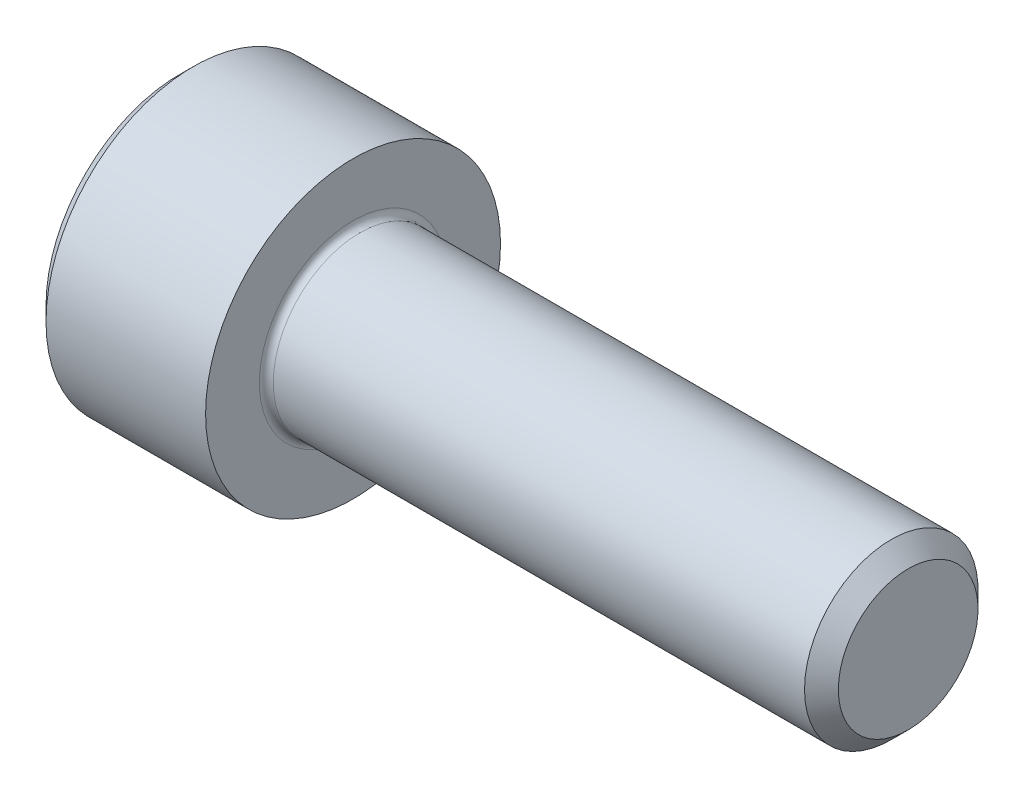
ISO-10303-21;
HEADER;
FILE_DESCRIPTION(('STEP AP214'),'2;1');
FILE_NAME('part.step','',(''),(''),'','','');
FILE_SCHEMA(('AUTOMOTIVE_DESIGN { 1 0 10303 214 1 1 1 1 }'));
ENDSEC;
DATA;
#1=APPLICATION_CONTEXT('core data for automotive mechanical design processes');
#2=APPLICATION_PROTOCOL_DEFINITION('international standard','automotive_design',2000,#1);
#3=PRODUCT_CONTEXT('',#1,'mechanical');
#4=PRODUCT('Part','Part','',(#3));
#5=PRODUCT_RELATED_PRODUCT_CATEGORY('part','',(#4));
#6=PRODUCT_DEFINITION_FORMATION('','',#4);
#7=PRODUCT_DEFINITION_CONTEXT('part definition',#1,'design');
#8=PRODUCT_DEFINITION('design','',#6,#7);
#9=PRODUCT_DEFINITION_SHAPE('','',#8);
#10=(LENGTH_UNIT() NAMED_UNIT(*) SI_UNIT(.MILLI.,.METRE.));
#11=(NAMED_UNIT(*) PLANE_ANGLE_UNIT() SI_UNIT($,.RADIAN.));
#12=(NAMED_UNIT(*) SI_UNIT($,.STERADIAN.) SOLID_ANGLE_UNIT());
#13=UNCERTAINTY_MEASURE_WITH_UNIT(LENGTH_MEASURE(1.E-05),#10,'distance_accuracy_value','');
#14=(GEOMETRIC_REPRESENTATION_CONTEXT(3) GLOBAL_UNCERTAINTY_ASSIGNED_CONTEXT((#13)) GLOBAL_UNIT_ASSIGNED_CONTEXT((#10,
#11,#12)) REPRESENTATION_CONTEXT('',''));
#15=CARTESIAN_POINT('',(0.,0.,0.));
#16=DIRECTION('',(0.,0.,1.));
#17=DIRECTION('',(1.,0.,0.));
#18=AXIS2_PLACEMENT_3D('',#15,#16,#17);
#19=CARTESIAN_POINT('',(0.,0.,0.));
#20=DIRECTION('',(-1.,0.,0.));
#21=DIRECTION('',(0.,0.,1.));
#22=AXIS2_PLACEMENT_3D('',#19,#20,#21);
#23=PLANE('',#22);
#24=DIRECTION('',(0.,-0.499999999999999,0.866025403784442));
#25=VECTOR('',#24,1.);
#26=CARTESIAN_POINT('',(-4.44089209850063E-13,1.77304267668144,-1.38777878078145E-13));
#27=LINE('',#26,#25);
#28=CARTESIAN_POINT('',(-4.44089209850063E-13,1.77304267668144,-1.38777878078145E-13));
#29=VERTEX_POINT('',#28);
#30=CARTESIAN_POINT('',(0.,0.886521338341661,1.53549999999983));
#31=VERTEX_POINT('',#30);
#32=EDGE_CURVE('E268',#29,#31,#27,.T.);
#33=ORIENTED_EDGE('',*,*,#32,.T.);
#34=DIRECTION('',(0.,1.,0.));
#35=VECTOR('',#34,1.);
#36=CARTESIAN_POINT('',(0.,-0.886521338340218,1.53550000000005));
#37=LINE('',#36,#35);
#38=CARTESIAN_POINT('',(0.,-0.886521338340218,1.53550000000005));
#39=VERTEX_POINT('',#38);
#40=EDGE_CURVE('E128',#39,#31,#37,.T.);
#41=ORIENTED_EDGE('',*,*,#40,.F.);
#42=DIRECTION('',(0.,-0.500000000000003,-0.866025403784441));
#43=VECTOR('',#42,1.);
#44=CARTESIAN_POINT('',(0.,-0.886521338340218,1.53550000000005));
#45=LINE('',#44,#43);
#46=CARTESIAN_POINT('',(-4.44089209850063E-13,-1.77304267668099,4.16333634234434E-13));
#47=VERTEX_POINT('',#46);
#48=EDGE_CURVE('E271',#39,#47,#45,.T.);
#49=ORIENTED_EDGE('',*,*,#48,.T.);
#50=DIRECTION('',(0.,0.499999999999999,-0.866025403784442));
#51=VECTOR('',#50,1.);
#52=CARTESIAN_POINT('',(-4.44089209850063E-13,-1.77304267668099,4.16333634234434E-13));
#53=LINE('',#52,#51);
#54=CARTESIAN_POINT('',(-4.44089209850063E-13,-0.886521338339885,-1.53550000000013));
#55=VERTEX_POINT('',#54);
#56=EDGE_CURVE('E274',#47,#55,#53,.T.);
#57=ORIENTED_EDGE('',*,*,#56,.T.);
#58=DIRECTION('',(0.,-1.,0.));
#59=VECTOR('',#58,1.);
#60=CARTESIAN_POINT('',(-4.44089209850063E-13,0.886521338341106,-1.53550000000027));
#61=LINE('',#60,#59);
#62=CARTESIAN_POINT('',(-4.44089209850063E-13,0.886521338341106,-1.53550000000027));
#63=VERTEX_POINT('',#62);
#64=EDGE_CURVE('E277',#63,#55,#61,.T.);
#65=ORIENTED_EDGE('',*,*,#64,.F.);
#66=DIRECTION('',(0.,-0.500000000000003,-0.866025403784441));
#67=VECTOR('',#66,1.);
#68=CARTESIAN_POINT('',(-4.44089209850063E-13,1.77304267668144,-1.38777878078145E-13));
#69=LINE('',#68,#67);
#70=EDGE_CURVE('E123',#29,#63,#69,.T.);
#71=ORIENTED_EDGE('',*,*,#70,.F.);
#72=EDGE_LOOP('',(#33,#41,#49,#57,#65,#71));
#73=FACE_BOUND('',#72,.T.);
#74=CARTESIAN_POINT('',(0.,0.,0.));
#75=DIRECTION('',(-1.,0.,0.));
#76=DIRECTION('',(0.,0.,1.));
#77=AXIS2_PLACEMENT_3D('',#74,#75,#76);
#78=CIRCLE('',#77,3.85);
#79=CARTESIAN_POINT('',(0.,0.,3.85000000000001));
#80=VERTEX_POINT('',#79);
#81=EDGE_CURVE('E152',#80,#80,#78,.T.);
#82=ORIENTED_EDGE('',*,*,#81,.T.);
#83=EDGE_LOOP('',(#82));
#84=FACE_BOUND('',#83,.T.);
#85=ADVANCED_FACE('F36',(#73,#84),#23,.T.);
#86=CARTESIAN_POINT('',(0.,0.,0.));
#87=DIRECTION('',(1.,0.,0.));
#88=DIRECTION('',(0.,0.,-1.));
#89=AXIS2_PLACEMENT_3D('',#86,#87,#88);
#90=CONICAL_SURFACE('',#89,3.85,0.785398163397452);
#91=CARTESIAN_POINT('',(0.400000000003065,1.11022302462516E-13,2.4980018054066E-13));
#92=DIRECTION('',(-1.,0.,0.));
#93=DIRECTION('',(0.,0.,1.));
#94=AXIS2_PLACEMENT_3D('',#91,#92,#93);
#95=CIRCLE('',#94,4.25);
#96=CARTESIAN_POINT('',(0.400000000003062,1.12511562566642E-13,4.25000000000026));
#97=VERTEX_POINT('',#96);
#98=EDGE_CURVE('E149',#97,#97,#95,.T.);
#99=ORIENTED_EDGE('',*,*,#98,.T.);
#100=EDGE_LOOP('',(#99));
#101=FACE_BOUND('',#100,.T.);
#102=ORIENTED_EDGE('',*,*,#81,.F.);
#103=EDGE_LOOP('',(#102));
#104=FACE_BOUND('',#103,.T.);
#105=ADVANCED_FACE('F173',(#101,#104),#90,.T.);
#106=CARTESIAN_POINT('',(-31.7500000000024,5.55111512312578E-13,1.38777878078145E-13));
#107=DIRECTION('',(-1.,0.,0.));
#108=DIRECTION('',(0.,0.,1.));
#109=AXIS2_PLACEMENT_3D('',#106,#107,#108);
#110=CYLINDRICAL_SURFACE('',#109,4.25);
#111=CARTESIAN_POINT('',(4.99999999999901,1.11022302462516E-13,8.88178419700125E-13));
#112=DIRECTION('',(-1.,0.,0.));
#113=DIRECTION('',(0.,0.,1.));
#114=AXIS2_PLACEMENT_3D('',#111,#112,#113);
#115=CIRCLE('',#114,4.25);
#116=CARTESIAN_POINT('',(4.999999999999,1.12511562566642E-13,4.2500000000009));
#117=VERTEX_POINT('',#116);
#118=EDGE_CURVE('E146',#117,#117,#115,.T.);
#119=ORIENTED_EDGE('',*,*,#118,.T.);
#120=EDGE_LOOP('',(#119));
#121=FACE_BOUND('',#120,.T.);
#122=ORIENTED_EDGE('',*,*,#98,.F.);
#123=EDGE_LOOP('',(#122));
#124=FACE_BOUND('',#123,.T.);
#125=ADVANCED_FACE('F178',(#121,#124),#110,.T.);
#126=CARTESIAN_POINT('',(5.00000000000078,4.25000000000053,0.));
#127=DIRECTION('',(1.,0.,0.));
#128=DIRECTION('',(0.,0.,-1.));
#129=AXIS2_PLACEMENT_3D('',#126,#127,#128);
#130=PLANE('',#129);
#131=CARTESIAN_POINT('',(4.99999999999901,1.11022302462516E-13,8.88178419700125E-13));
#132=DIRECTION('',(1.,0.,0.));
#133=DIRECTION('',(0.,0.,-1.));
#134=AXIS2_PLACEMENT_3D('',#131,#132,#133);
#135=CIRCLE('',#134,2.69999999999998);
#136=CARTESIAN_POINT('',(4.99999999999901,1.10076184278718E-13,-2.69999999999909));
#137=VERTEX_POINT('',#136);
#138=EDGE_CURVE('E44',#137,#137,#135,.F.);
#139=ORIENTED_EDGE('',*,*,#138,.T.);
#140=EDGE_LOOP('',(#139));
#141=FACE_BOUND('',#140,.T.);
#142=ORIENTED_EDGE('',*,*,#118,.F.);
#143=EDGE_LOOP('',(#142));
#144=FACE_BOUND('',#143,.T.);
#145=ADVANCED_FACE('F157',(#141,#144),#130,.T.);
#146=CARTESIAN_POINT('',(-31.7500000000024,5.55111512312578E-13,1.38777878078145E-13));
#147=DIRECTION('',(-1.,0.,0.));
#148=DIRECTION('',(0.,0.,1.));
#149=AXIS2_PLACEMENT_3D('',#146,#147,#148);
#150=CYLINDRICAL_SURFACE('',#149,2.49999999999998);
#151=CARTESIAN_POINT('',(5.20000000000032,1.11022302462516E-13,1.13797860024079E-12));
#152=DIRECTION('',(1.,0.,0.));
#153=DIRECTION('',(0.,0.,-1.));
#154=AXIS2_PLACEMENT_3D('',#151,#152,#153);
#155=CIRCLE('',#154,2.49999999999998);
#156=CARTESIAN_POINT('',(5.20000000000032,1.10146267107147E-13,-2.49999999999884));
#157=VERTEX_POINT('',#156);
#158=EDGE_CURVE('E11',#157,#157,#155,.T.);
#159=ORIENTED_EDGE('',*,*,#158,.T.);
#160=EDGE_LOOP('',(#159));
#161=FACE_BOUND('',#160,.T.);
#162=CARTESIAN_POINT('',(20.5124999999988,5.55111512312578E-13,3.60822483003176E-13));
#163=DIRECTION('',(-1.,0.,0.));
#164=DIRECTION('',(0.,0.,1.));
#165=AXIS2_PLACEMENT_3D('',#162,#163,#164);
#166=CIRCLE('',#165,2.49999999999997);
#167=CARTESIAN_POINT('',(20.5124999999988,5.55987547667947E-13,2.50000000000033));
#168=VERTEX_POINT('',#167);
#169=EDGE_CURVE('E143',#168,#168,#166,.T.);
#170=ORIENTED_EDGE('',*,*,#169,.T.);
#171=EDGE_LOOP('',(#170));
#172=FACE_BOUND('',#171,.T.);
#173=ADVANCED_FACE('F188',(#161,#172),#150,.T.);
#174=CARTESIAN_POINT('',(20.9999999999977,3.33066907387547E-13,1.94289029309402E-13));
#175=DIRECTION('',(-1.,0.,0.));
#176=DIRECTION('',(0.,0.,1.));
#177=AXIS2_PLACEMENT_3D('',#174,#175,#176);
#178=CONICAL_SURFACE('',#177,2.0125,0.785398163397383);
#179=ORIENTED_EDGE('',*,*,#169,.F.);
#180=EDGE_LOOP('',(#179));
#181=FACE_BOUND('',#180,.T.);
#182=CARTESIAN_POINT('',(20.9999999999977,3.33066907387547E-13,1.94289029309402E-13));
#183=DIRECTION('',(-1.,0.,0.));
#184=DIRECTION('',(0.,0.,1.));
#185=AXIS2_PLACEMENT_3D('',#182,#183,#184);
#186=CIRCLE('',#185,2.0125);
#187=CARTESIAN_POINT('',(20.9999999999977,3.33772115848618E-13,2.0125000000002));
#188=VERTEX_POINT('',#187);
#189=EDGE_CURVE('E139',#188,#188,#186,.T.);
#190=ORIENTED_EDGE('',*,*,#189,.T.);
#191=EDGE_LOOP('',(#190));
#192=FACE_BOUND('',#191,.T.);
#193=ADVANCED_FACE('F168',(#181,#192),#178,.T.);
#194=CARTESIAN_POINT('',(20.9999999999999,2.01249999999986,3.33066907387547E-13));
#195=DIRECTION('',(1.,0.,0.));
#196=DIRECTION('',(0.,0.,-1.));
#197=AXIS2_PLACEMENT_3D('',#194,#195,#196);
#198=PLANE('',#197);
#199=ORIENTED_EDGE('',*,*,#189,.F.);
#200=EDGE_LOOP('',(#199));
#201=FACE_BOUND('',#200,.T.);
#202=ADVANCED_FACE('F161',(#201),#198,.T.);
#203=CARTESIAN_POINT('',(5.20000000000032,1.11022302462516E-13,1.13797860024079E-12));
#204=DIRECTION('',(1.,0.,0.));
#205=DIRECTION('',(0.,0.,-1.));
#206=AXIS2_PLACEMENT_3D('',#203,#204,#205);
#207=TOROIDAL_SURFACE('',#206,2.69999999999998,0.2);
#208=ORIENTED_EDGE('',*,*,#158,.F.);
#209=EDGE_LOOP('',(#208));
#210=FACE_BOUND('',#209,.T.);
#211=ORIENTED_EDGE('',*,*,#138,.F.);
#212=EDGE_LOOP('',(#211));
#213=FACE_BOUND('',#212,.T.);
#214=ADVANCED_FACE('F38',(#210,#213),#207,.F.);
#215=CARTESIAN_POINT('',(2.00000000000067,1.77304267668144,2.22044604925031E-13));
#216=DIRECTION('',(0.,-0.866025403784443,-0.5));
#217=DIRECTION('',(0.,0.499999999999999,-0.866025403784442));
#218=AXIS2_PLACEMENT_3D('',#215,#216,#217);
#219=PLANE('',#218);
#220=ORIENTED_EDGE('',*,*,#32,.F.);
#221=DIRECTION('',(-1.,0.,0.));
#222=VECTOR('',#221,1.);
#223=CARTESIAN_POINT('',(2.00000000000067,1.77304267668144,2.22044604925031E-13));
#224=LINE('',#223,#222);
#225=CARTESIAN_POINT('',(2.00000000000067,1.77304267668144,2.22044604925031E-13));
#226=VERTEX_POINT('',#225);
#227=EDGE_CURVE('E267',#226,#29,#224,.T.);
#228=ORIENTED_EDGE('',*,*,#227,.F.);
#229=DIRECTION('',(0.,-0.499999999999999,0.866025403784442));
#230=VECTOR('',#229,1.);
#231=CARTESIAN_POINT('',(2.00000000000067,1.77304267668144,2.22044604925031E-13));
#232=LINE('',#231,#230);
#233=CARTESIAN_POINT('',(1.99999999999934,1.32978200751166,0.767749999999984));
#234=VERTEX_POINT('',#233);
#235=EDGE_CURVE('E51',#226,#234,#232,.T.);
#236=ORIENTED_EDGE('',*,*,#235,.T.);
#237=CARTESIAN_POINT('',(1.99999999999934,0.886521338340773,1.53549999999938));
#238=VERTEX_POINT('',#237);
#239=EDGE_CURVE('E109',#234,#238,#232,.T.);
#240=ORIENTED_EDGE('',*,*,#239,.T.);
#241=DIRECTION('',(-1.,0.,0.));
#242=VECTOR('',#241,1.);
#243=CARTESIAN_POINT('',(1.99999999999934,0.886521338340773,1.53549999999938));
#244=LINE('',#243,#242);
#245=EDGE_CURVE('E121',#238,#31,#244,.T.);
#246=ORIENTED_EDGE('',*,*,#245,.T.);
#247=EDGE_LOOP('',(#220,#228,#236,#240,#246));
#248=FACE_BOUND('',#247,.T.);
#249=ADVANCED_FACE('F120',(#248),#219,.T.);
#250=CARTESIAN_POINT('',(1.99999999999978,-0.886521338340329,1.53549999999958));
#251=DIRECTION('',(0.,0.,1.));
#252=DIRECTION('',(0.,-1.,0.));
#253=AXIS2_PLACEMENT_3D('',#250,#251,#252);
#254=PLANE('',#253);
#255=ORIENTED_EDGE('',*,*,#40,.T.);
#256=ORIENTED_EDGE('',*,*,#245,.F.);
#257=DIRECTION('',(0.,1.,0.));
#258=VECTOR('',#257,1.);
#259=CARTESIAN_POINT('',(1.99999999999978,-0.886521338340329,1.53549999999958));
#260=LINE('',#259,#258);
#261=CARTESIAN_POINT('',(1.99999999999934,0.,1.53550000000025));
#262=VERTEX_POINT('',#261);
#263=EDGE_CURVE('E107',#262,#238,#260,.T.);
#264=ORIENTED_EDGE('',*,*,#263,.F.);
#265=CARTESIAN_POINT('',(1.99999999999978,-0.886521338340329,1.53549999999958));
#266=VERTEX_POINT('',#265);
#267=EDGE_CURVE('E117',#266,#262,#260,.T.);
#268=ORIENTED_EDGE('',*,*,#267,.F.);
#269=DIRECTION('',(-1.,0.,0.));
#270=VECTOR('',#269,1.);
#271=CARTESIAN_POINT('',(1.99999999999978,-0.886521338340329,1.53549999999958));
#272=LINE('',#271,#270);
#273=EDGE_CURVE('E130',#266,#39,#272,.T.);
#274=ORIENTED_EDGE('',*,*,#273,.T.);
#275=EDGE_LOOP('',(#255,#256,#264,#268,#274));
#276=FACE_BOUND('',#275,.T.);
#277=ADVANCED_FACE('F125',(#276),#254,.F.);
#278=CARTESIAN_POINT('',(1.99999999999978,-0.886521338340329,1.53549999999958));
#279=DIRECTION('',(0.,0.86602540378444,-0.500000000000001));
#280=DIRECTION('',(0.,0.500000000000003,0.866025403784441));
#281=AXIS2_PLACEMENT_3D('',#278,#279,#280);
#282=PLANE('',#281);
#283=ORIENTED_EDGE('',*,*,#48,.F.);
#284=ORIENTED_EDGE('',*,*,#273,.F.);
#285=DIRECTION('',(0.,-0.500000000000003,-0.866025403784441));
#286=VECTOR('',#285,1.);
#287=CARTESIAN_POINT('',(1.99999999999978,-0.886521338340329,1.53549999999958));
#288=LINE('',#287,#286);
#289=CARTESIAN_POINT('',(1.99999999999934,-1.32978200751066,0.767750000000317));
#290=VERTEX_POINT('',#289);
#291=EDGE_CURVE('E248',#266,#290,#288,.T.);
#292=ORIENTED_EDGE('',*,*,#291,.T.);
#293=CARTESIAN_POINT('',(1.99999999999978,-1.77304267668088,1.94289029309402E-13));
#294=VERTEX_POINT('',#293);
#295=EDGE_CURVE('E250',#290,#294,#288,.T.);
#296=ORIENTED_EDGE('',*,*,#295,.T.);
#297=DIRECTION('',(-1.,0.,0.));
#298=VECTOR('',#297,1.);
#299=CARTESIAN_POINT('',(1.99999999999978,-1.77304267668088,1.94289029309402E-13));
#300=LINE('',#299,#298);
#301=EDGE_CURVE('E135',#294,#47,#300,.T.);
#302=ORIENTED_EDGE('',*,*,#301,.T.);
#303=EDGE_LOOP('',(#283,#284,#292,#296,#302));
#304=FACE_BOUND('',#303,.T.);
#305=ADVANCED_FACE('F200',(#304),#282,.T.);
#306=CARTESIAN_POINT('',(1.99999999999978,-1.77304267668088,1.94289029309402E-13));
#307=DIRECTION('',(0.,0.866025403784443,0.5));
#308=DIRECTION('',(0.,-0.499999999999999,0.866025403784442));
#309=AXIS2_PLACEMENT_3D('',#306,#307,#308);
#310=PLANE('',#309);
#311=ORIENTED_EDGE('',*,*,#56,.F.);
#312=ORIENTED_EDGE('',*,*,#301,.F.);
#313=DIRECTION('',(0.,0.499999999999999,-0.866025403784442));
#314=VECTOR('',#313,1.);
#315=CARTESIAN_POINT('',(1.99999999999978,-1.77304267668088,1.94289029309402E-13));
#316=LINE('',#315,#314);
#317=CARTESIAN_POINT('',(1.99999999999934,-1.32978200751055,-0.767749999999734));
#318=VERTEX_POINT('',#317);
#319=EDGE_CURVE('E253',#294,#318,#316,.T.);
#320=ORIENTED_EDGE('',*,*,#319,.T.);
#321=CARTESIAN_POINT('',(1.99999999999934,-0.886521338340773,-1.53550000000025));
#322=VERTEX_POINT('',#321);
#323=EDGE_CURVE('E257',#318,#322,#316,.T.);
#324=ORIENTED_EDGE('',*,*,#323,.T.);
#325=DIRECTION('',(-1.,0.,0.));
#326=VECTOR('',#325,1.);
#327=CARTESIAN_POINT('',(1.99999999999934,-0.886521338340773,-1.53550000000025));
#328=LINE('',#327,#326);
#329=EDGE_CURVE('E286',#322,#55,#328,.T.);
#330=ORIENTED_EDGE('',*,*,#329,.T.);
#331=EDGE_LOOP('',(#311,#312,#320,#324,#330));
#332=FACE_BOUND('',#331,.T.);
#333=ADVANCED_FACE('F203',(#332),#310,.T.);
#334=CARTESIAN_POINT('',(1.99999999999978,0.886521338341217,-1.53550000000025));
#335=DIRECTION('',(0.,0.,-1.));
#336=DIRECTION('',(0.,1.,0.));
#337=AXIS2_PLACEMENT_3D('',#334,#335,#336);
#338=PLANE('',#337);
#339=ORIENTED_EDGE('',*,*,#64,.T.);
#340=ORIENTED_EDGE('',*,*,#329,.F.);
#341=DIRECTION('',(0.,-1.,0.));
#342=VECTOR('',#341,1.);
#343=CARTESIAN_POINT('',(1.99999999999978,0.886521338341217,-1.53550000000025));
#344=LINE('',#343,#342);
#345=CARTESIAN_POINT('',(1.99999999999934,5.55111512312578E-13,-1.5355));
#346=VERTEX_POINT('',#345);
#347=EDGE_CURVE('E261',#346,#322,#344,.T.);
#348=ORIENTED_EDGE('',*,*,#347,.F.);
#349=CARTESIAN_POINT('',(1.99999999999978,0.886521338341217,-1.53550000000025));
#350=VERTEX_POINT('',#349);
#351=EDGE_CURVE('E262',#350,#346,#344,.T.);
#352=ORIENTED_EDGE('',*,*,#351,.F.);
#353=DIRECTION('',(-1.,0.,0.));
#354=VECTOR('',#353,1.);
#355=CARTESIAN_POINT('',(1.99999999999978,0.886521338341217,-1.53550000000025));
#356=LINE('',#355,#354);
#357=EDGE_CURVE('E283',#350,#63,#356,.T.);
#358=ORIENTED_EDGE('',*,*,#357,.T.);
#359=EDGE_LOOP('',(#339,#340,#348,#352,#358));
#360=FACE_BOUND('',#359,.T.);
#361=ADVANCED_FACE('F207',(#360),#338,.F.);
#362=CARTESIAN_POINT('',(2.00000000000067,1.77304267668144,2.22044604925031E-13));
#363=DIRECTION('',(0.,0.86602540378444,-0.500000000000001));
#364=DIRECTION('',(0.,0.500000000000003,0.866025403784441));
#365=AXIS2_PLACEMENT_3D('',#362,#363,#364);
#366=PLANE('',#365);
#367=ORIENTED_EDGE('',*,*,#70,.T.);
#368=ORIENTED_EDGE('',*,*,#357,.F.);
#369=DIRECTION('',(0.,-0.500000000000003,-0.866025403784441));
#370=VECTOR('',#369,1.);
#371=CARTESIAN_POINT('',(2.00000000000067,1.77304267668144,2.22044604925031E-13));
#372=LINE('',#371,#370);
#373=CARTESIAN_POINT('',(1.99999999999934,1.32978200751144,-0.76775000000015));
#374=VERTEX_POINT('',#373);
#375=EDGE_CURVE('E265',#374,#350,#372,.T.);
#376=ORIENTED_EDGE('',*,*,#375,.F.);
#377=EDGE_CURVE('E239',#226,#374,#372,.T.);
#378=ORIENTED_EDGE('',*,*,#377,.F.);
#379=ORIENTED_EDGE('',*,*,#227,.T.);
#380=EDGE_LOOP('',(#367,#368,#376,#378,#379));
#381=FACE_BOUND('',#380,.T.);
#382=ADVANCED_FACE('F211',(#381),#366,.F.);
#383=CARTESIAN_POINT('',(1.99999999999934,0.886521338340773,1.53549999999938));
#384=DIRECTION('',(-1.,0.,0.));
#385=DIRECTION('',(0.,0.,1.));
#386=AXIS2_PLACEMENT_3D('',#383,#384,#385);
#387=PLANE('',#386);
#388=CARTESIAN_POINT('',(1.99999999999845,4.44089209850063E-13,-2.22044604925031E-13));
#389=DIRECTION('',(-1.,0.,0.));
#390=DIRECTION('',(0.,0.,1.));
#391=AXIS2_PLACEMENT_3D('',#388,#389,#390);
#392=CIRCLE('',#391,1.5355);
#393=EDGE_CURVE('E129',#290,#262,#392,.T.);
#394=ORIENTED_EDGE('',*,*,#393,.F.);
#395=ORIENTED_EDGE('',*,*,#291,.F.);
#396=ORIENTED_EDGE('',*,*,#267,.T.);
#397=EDGE_LOOP('',(#394,#395,#396));
#398=FACE_BOUND('',#397,.T.);
#399=ADVANCED_FACE('F215',(#398),#387,.T.);
#400=EDGE_CURVE('E133',#318,#290,#392,.T.);
#401=ORIENTED_EDGE('',*,*,#400,.F.);
#402=ORIENTED_EDGE('',*,*,#319,.F.);
#403=ORIENTED_EDGE('',*,*,#295,.F.);
#404=EDGE_LOOP('',(#401,#402,#403));
#405=FACE_BOUND('',#404,.T.);
#406=ADVANCED_FACE('F218',(#405),#387,.T.);
#407=EDGE_CURVE('E292',#346,#318,#392,.T.);
#408=ORIENTED_EDGE('',*,*,#407,.F.);
#409=ORIENTED_EDGE('',*,*,#347,.T.);
#410=ORIENTED_EDGE('',*,*,#323,.F.);
#411=EDGE_LOOP('',(#408,#409,#410));
#412=FACE_BOUND('',#411,.T.);
#413=ADVANCED_FACE('F223',(#412),#387,.T.);
#414=EDGE_CURVE('E242',#374,#346,#392,.T.);
#415=ORIENTED_EDGE('',*,*,#414,.F.);
#416=ORIENTED_EDGE('',*,*,#375,.T.);
#417=ORIENTED_EDGE('',*,*,#351,.T.);
#418=EDGE_LOOP('',(#415,#416,#417));
#419=FACE_BOUND('',#418,.T.);
#420=ADVANCED_FACE('F230',(#419),#387,.T.);
#421=EDGE_CURVE('E140',#234,#374,#392,.T.);
#422=ORIENTED_EDGE('',*,*,#421,.F.);
#423=ORIENTED_EDGE('',*,*,#235,.F.);
#424=ORIENTED_EDGE('',*,*,#377,.T.);
#425=EDGE_LOOP('',(#422,#423,#424));
#426=FACE_BOUND('',#425,.T.);
#427=ADVANCED_FACE('F226',(#426),#387,.T.);
#428=EDGE_CURVE('E112',#262,#234,#392,.T.);
#429=ORIENTED_EDGE('',*,*,#428,.F.);
#430=ORIENTED_EDGE('',*,*,#263,.T.);
#431=ORIENTED_EDGE('',*,*,#239,.F.);
#432=EDGE_LOOP('',(#429,#430,#431));
#433=FACE_BOUND('',#432,.T.);
#434=ADVANCED_FACE('F108',(#433),#387,.T.);
#435=CARTESIAN_POINT('',(1.99999999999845,4.44089209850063E-13,-2.22044604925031E-13));
#436=DIRECTION('',(-1.,0.,0.));
#437=DIRECTION('',(0.,0.,1.));
#438=AXIS2_PLACEMENT_3D('',#435,#436,#437);
#439=CONICAL_SURFACE('',#438,1.5355,1.0471975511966);
#440=CARTESIAN_POINT('',(2.886521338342,-3.33066907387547E-13,2.4980018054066E-13));
#441=VERTEX_POINT('',#440);
#442=VERTEX_LOOP('',#441);
#443=FACE_BOUND('',#442,.T.);
#444=ORIENTED_EDGE('',*,*,#428,.T.);
#445=ORIENTED_EDGE('',*,*,#421,.T.);
#446=ORIENTED_EDGE('',*,*,#414,.T.);
#447=ORIENTED_EDGE('',*,*,#407,.T.);
#448=ORIENTED_EDGE('',*,*,#400,.T.);
#449=ORIENTED_EDGE('',*,*,#393,.T.);
#450=EDGE_LOOP('',(#444,#445,#446,#447,#448,#449));
#451=FACE_BOUND('',#450,.T.);
#452=ADVANCED_FACE('F195',(#443,#451),#439,.F.);
#453=CLOSED_SHELL('',(#85,#105,#125,#145,#173,#193,#202,#214,#249,#277,#305,#333,#361,#382,#399,
#406,#413,#420,#427,#434,#452));
#454=MANIFOLD_SOLID_BREP('B2',#453);
#455=ADVANCED_BREP_SHAPE_REPRESENTATION('',(#18,#454),#14);
#456=SHAPE_DEFINITION_REPRESENTATION(#9,#455);
ENDSEC;
END-ISO-10303-21;
